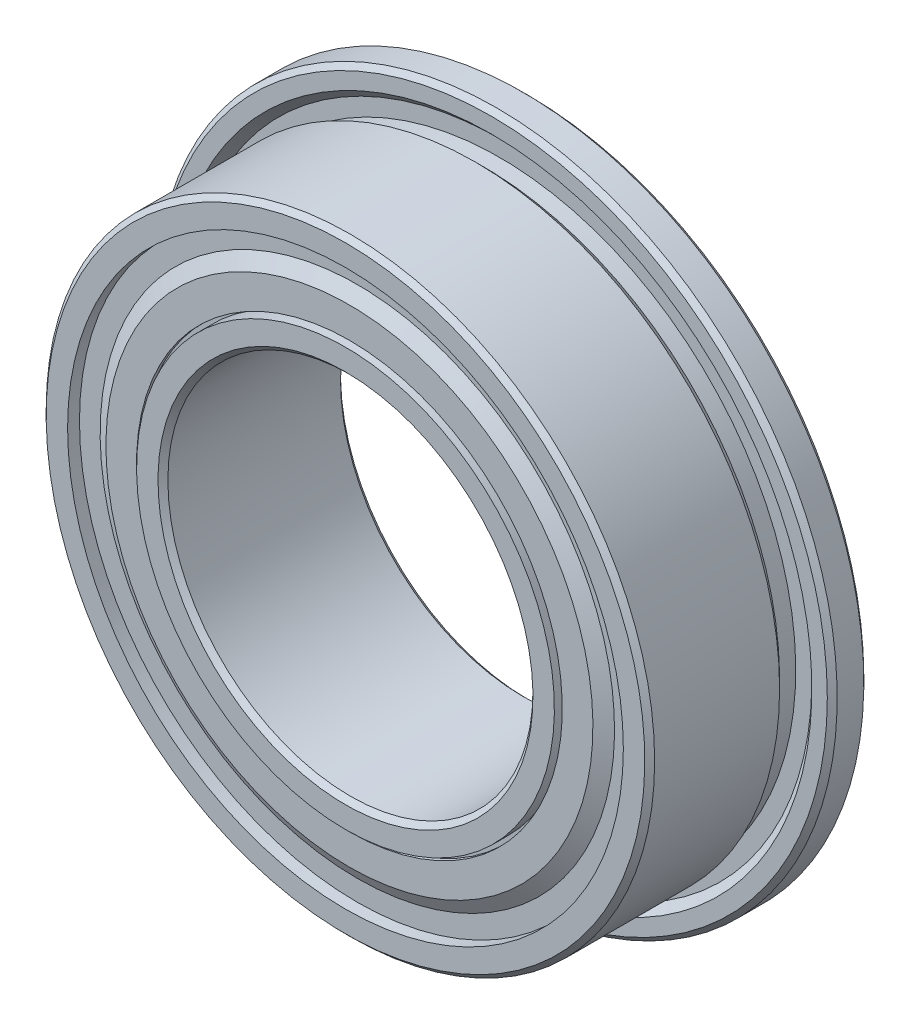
ISO-10303-21;
HEADER;
FILE_DESCRIPTION(('STEP AP214'),'2;1');
FILE_NAME('part.step','',(''),(''),'','','');
FILE_SCHEMA(('AUTOMOTIVE_DESIGN { 1 0 10303 214 1 1 1 1 }'));
ENDSEC;
DATA;
#1=APPLICATION_CONTEXT('core data for automotive mechanical design processes');
#2=APPLICATION_PROTOCOL_DEFINITION('international standard','automotive_design',2000,#1);
#3=PRODUCT_CONTEXT('',#1,'mechanical');
#4=PRODUCT('Part','Part','',(#3));
#5=PRODUCT_RELATED_PRODUCT_CATEGORY('part','',(#4));
#6=PRODUCT_DEFINITION_FORMATION('','',#4);
#7=PRODUCT_DEFINITION_CONTEXT('part definition',#1,'design');
#8=PRODUCT_DEFINITION('design','',#6,#7);
#9=PRODUCT_DEFINITION_SHAPE('','',#8);
#10=(LENGTH_UNIT() NAMED_UNIT(*) SI_UNIT(.MILLI.,.METRE.));
#11=(NAMED_UNIT(*) PLANE_ANGLE_UNIT() SI_UNIT($,.RADIAN.));
#12=(NAMED_UNIT(*) SI_UNIT($,.STERADIAN.) SOLID_ANGLE_UNIT());
#13=UNCERTAINTY_MEASURE_WITH_UNIT(LENGTH_MEASURE(1.E-05),#10,'distance_accuracy_value','');
#14=(GEOMETRIC_REPRESENTATION_CONTEXT(3) GLOBAL_UNCERTAINTY_ASSIGNED_CONTEXT((#13)) GLOBAL_UNIT_ASSIGNED_CONTEXT((#10,
#11,#12)) REPRESENTATION_CONTEXT('',''));
#15=CARTESIAN_POINT('',(0.,0.,0.));
#16=DIRECTION('',(0.,0.,1.));
#17=DIRECTION('',(1.,0.,0.));
#18=AXIS2_PLACEMENT_3D('',#15,#16,#17);
#19=CARTESIAN_POINT('',(0.,0.,0.));
#20=DIRECTION('',(0.,0.,1.));
#21=DIRECTION('',(0.,-1.,0.));
#22=AXIS2_PLACEMENT_3D('',#19,#20,#21);
#23=CYLINDRICAL_SURFACE('',#22,4.56666666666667);
#24=CARTESIAN_POINT('',(0.,0.,-1.24));
#25=DIRECTION('',(0.,0.,1.));
#26=DIRECTION('',(0.,-1.,0.));
#27=AXIS2_PLACEMENT_3D('',#24,#25,#26);
#28=CIRCLE('',#27,4.56666666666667);
#29=CARTESIAN_POINT('',(0.,-4.56666666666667,-1.24));
#30=VERTEX_POINT('',#29);
#31=EDGE_CURVE('E75',#30,#30,#28,.T.);
#32=ORIENTED_EDGE('',*,*,#31,.F.);
#33=EDGE_LOOP('',(#32));
#34=FACE_BOUND('',#33,.T.);
#35=CARTESIAN_POINT('',(0.,0.,-1.305));
#36=DIRECTION('',(0.,0.,1.));
#37=DIRECTION('',(0.,-1.,0.));
#38=AXIS2_PLACEMENT_3D('',#35,#36,#37);
#39=CIRCLE('',#38,4.56666666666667);
#40=CARTESIAN_POINT('',(0.,-4.56666666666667,-1.305));
#41=VERTEX_POINT('',#40);
#42=EDGE_CURVE('E12',#41,#41,#39,.T.);
#43=ORIENTED_EDGE('',*,*,#42,.T.);
#44=EDGE_LOOP('',(#43));
#45=FACE_BOUND('',#44,.T.);
#46=ADVANCED_FACE('F47',(#34,#45),#23,.T.);
#47=CARTESIAN_POINT('',(0.,4.56666666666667,-1.305));
#48=DIRECTION('',(0.,0.,1.));
#49=DIRECTION('',(0.,-1.,0.));
#50=AXIS2_PLACEMENT_3D('',#47,#48,#49);
#51=PLANE('',#50);
#52=ORIENTED_EDGE('',*,*,#42,.F.);
#53=EDGE_LOOP('',(#52));
#54=FACE_BOUND('',#53,.T.);
#55=CARTESIAN_POINT('',(0.,0.,-1.305));
#56=DIRECTION('',(0.,0.,1.));
#57=DIRECTION('',(0.,-1.,0.));
#58=AXIS2_PLACEMENT_3D('',#55,#56,#57);
#59=CIRCLE('',#58,4.22694050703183);
#60=CARTESIAN_POINT('',(0.,-4.22694050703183,-1.305));
#61=VERTEX_POINT('',#60);
#62=EDGE_CURVE('E53',#61,#61,#59,.T.);
#63=ORIENTED_EDGE('',*,*,#62,.T.);
#64=EDGE_LOOP('',(#63));
#65=FACE_BOUND('',#64,.T.);
#66=ADVANCED_FACE('F82',(#54,#65),#51,.F.);
#67=CARTESIAN_POINT('',(0.,0.,-1.435));
#68=DIRECTION('',(0.,0.,1.));
#69=DIRECTION('',(0.,-1.,0.));
#70=AXIS2_PLACEMENT_3D('',#67,#68,#69);
#71=CONICAL_SURFACE('',#70,4.00177390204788,1.0471975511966);
#72=ORIENTED_EDGE('',*,*,#62,.F.);
#73=EDGE_LOOP('',(#72));
#74=FACE_BOUND('',#73,.T.);
#75=CARTESIAN_POINT('',(0.,0.,-1.435));
#76=DIRECTION('',(0.,0.,1.));
#77=DIRECTION('',(0.,-1.,0.));
#78=AXIS2_PLACEMENT_3D('',#75,#76,#77);
#79=CIRCLE('',#78,4.00177390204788);
#80=CARTESIAN_POINT('',(0.,-4.00177390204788,-1.435));
#81=VERTEX_POINT('',#80);
#82=EDGE_CURVE('E57',#81,#81,#79,.T.);
#83=ORIENTED_EDGE('',*,*,#82,.T.);
#84=EDGE_LOOP('',(#83));
#85=FACE_BOUND('',#84,.T.);
#86=ADVANCED_FACE('F86',(#74,#85),#71,.T.);
#87=CARTESIAN_POINT('',(0.,4.00177390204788,-1.435));
#88=DIRECTION('',(0.,0.,1.));
#89=DIRECTION('',(0.,-1.,0.));
#90=AXIS2_PLACEMENT_3D('',#87,#88,#89);
#91=PLANE('',#90);
#92=ORIENTED_EDGE('',*,*,#82,.F.);
#93=EDGE_LOOP('',(#92));
#94=FACE_BOUND('',#93,.T.);
#95=CARTESIAN_POINT('',(0.,0.,-1.435));
#96=DIRECTION('',(0.,0.,1.));
#97=DIRECTION('',(0.,-1.,0.));
#98=AXIS2_PLACEMENT_3D('',#95,#96,#97);
#99=CIRCLE('',#98,3.49833333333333);
#100=CARTESIAN_POINT('',(0.,-3.49833333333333,-1.435));
#101=VERTEX_POINT('',#100);
#102=EDGE_CURVE('E61',#101,#101,#99,.T.);
#103=ORIENTED_EDGE('',*,*,#102,.T.);
#104=EDGE_LOOP('',(#103));
#105=FACE_BOUND('',#104,.T.);
#106=ADVANCED_FACE('F91',(#94,#105),#91,.F.);
#107=CARTESIAN_POINT('',(0.,0.,0.));
#108=DIRECTION('',(0.,0.,1.));
#109=DIRECTION('',(0.,-1.,0.));
#110=AXIS2_PLACEMENT_3D('',#107,#108,#109);
#111=CYLINDRICAL_SURFACE('',#110,3.49833333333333);
#112=ORIENTED_EDGE('',*,*,#102,.F.);
#113=EDGE_LOOP('',(#112));
#114=FACE_BOUND('',#113,.T.);
#115=CARTESIAN_POINT('',(0.,0.,-1.37));
#116=DIRECTION('',(0.,0.,1.));
#117=DIRECTION('',(0.,-1.,0.));
#118=AXIS2_PLACEMENT_3D('',#115,#116,#117);
#119=CIRCLE('',#118,3.49833333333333);
#120=CARTESIAN_POINT('',(0.,-3.49833333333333,-1.37));
#121=VERTEX_POINT('',#120);
#122=EDGE_CURVE('E66',#121,#121,#119,.T.);
#123=ORIENTED_EDGE('',*,*,#122,.T.);
#124=EDGE_LOOP('',(#123));
#125=FACE_BOUND('',#124,.T.);
#126=ADVANCED_FACE('F97',(#114,#125),#111,.F.);
#127=CARTESIAN_POINT('',(0.,3.98435720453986,-1.37));
#128=DIRECTION('',(0.,0.,-1.));
#129=DIRECTION('',(0.,1.,0.));
#130=AXIS2_PLACEMENT_3D('',#127,#128,#129);
#131=PLANE('',#130);
#132=ORIENTED_EDGE('',*,*,#122,.F.);
#133=EDGE_LOOP('',(#132));
#134=FACE_BOUND('',#133,.T.);
#135=CARTESIAN_POINT('',(0.,0.,-1.37));
#136=DIRECTION('',(0.,0.,1.));
#137=DIRECTION('',(0.,-1.,0.));
#138=AXIS2_PLACEMENT_3D('',#135,#136,#137);
#139=CIRCLE('',#138,3.98435720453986);
#140=CARTESIAN_POINT('',(0.,-3.98435720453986,-1.37));
#141=VERTEX_POINT('',#140);
#142=EDGE_CURVE('E69',#141,#141,#139,.T.);
#143=ORIENTED_EDGE('',*,*,#142,.T.);
#144=EDGE_LOOP('',(#143));
#145=FACE_BOUND('',#144,.T.);
#146=ADVANCED_FACE('F101',(#134,#145),#131,.F.);
#147=CARTESIAN_POINT('',(0.,0.,-1.24));
#148=DIRECTION('',(0.,0.,1.));
#149=DIRECTION('',(0.,-1.,0.));
#150=AXIS2_PLACEMENT_3D('',#147,#148,#149);
#151=CONICAL_SURFACE('',#150,4.20952380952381,1.04719755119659);
#152=ORIENTED_EDGE('',*,*,#142,.F.);
#153=EDGE_LOOP('',(#152));
#154=FACE_BOUND('',#153,.T.);
#155=CARTESIAN_POINT('',(0.,0.,-1.24));
#156=DIRECTION('',(0.,0.,1.));
#157=DIRECTION('',(0.,-1.,0.));
#158=AXIS2_PLACEMENT_3D('',#155,#156,#157);
#159=CIRCLE('',#158,4.20952380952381);
#160=CARTESIAN_POINT('',(0.,-4.20952380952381,-1.24));
#161=VERTEX_POINT('',#160);
#162=EDGE_CURVE('E72',#161,#161,#159,.T.);
#163=ORIENTED_EDGE('',*,*,#162,.T.);
#164=EDGE_LOOP('',(#163));
#165=FACE_BOUND('',#164,.T.);
#166=ADVANCED_FACE('F105',(#154,#165),#151,.F.);
#167=CARTESIAN_POINT('',(0.,4.56666666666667,-1.24));
#168=DIRECTION('',(0.,0.,-1.));
#169=DIRECTION('',(0.,1.,0.));
#170=AXIS2_PLACEMENT_3D('',#167,#168,#169);
#171=PLANE('',#170);
#172=ORIENTED_EDGE('',*,*,#162,.F.);
#173=EDGE_LOOP('',(#172));
#174=FACE_BOUND('',#173,.T.);
#175=ORIENTED_EDGE('',*,*,#31,.T.);
#176=EDGE_LOOP('',(#175));
#177=FACE_BOUND('',#176,.T.);
#178=ADVANCED_FACE('F79',(#174,#177),#171,.F.);
#179=CLOSED_SHELL('',(#46,#66,#86,#106,#126,#146,#166,#178));
#180=MANIFOLD_SOLID_BREP('B2',#179);
#181=CARTESIAN_POINT('',(0.,0.,0.));
#182=DIRECTION('',(0.,0.,1.));
#183=DIRECTION('',(0.,-1.,0.));
#184=AXIS2_PLACEMENT_3D('',#181,#182,#183);
#185=CYLINDRICAL_SURFACE('',#184,4.56666666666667);
#186=CARTESIAN_POINT('',(0.,0.,1.305));
#187=DIRECTION('',(0.,0.,1.));
#188=DIRECTION('',(0.,-1.,0.));
#189=AXIS2_PLACEMENT_3D('',#186,#187,#188);
#190=CIRCLE('',#189,4.56666666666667);
#191=CARTESIAN_POINT('',(0.,-4.56666666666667,1.305));
#192=VERTEX_POINT('',#191);
#193=EDGE_CURVE('E46',#192,#192,#190,.T.);
#194=ORIENTED_EDGE('',*,*,#193,.F.);
#195=EDGE_LOOP('',(#194));
#196=FACE_BOUND('',#195,.T.);
#197=CARTESIAN_POINT('',(0.,0.,1.24));
#198=DIRECTION('',(0.,0.,1.));
#199=DIRECTION('',(0.,-1.,0.));
#200=AXIS2_PLACEMENT_3D('',#197,#198,#199);
#201=CIRCLE('',#200,4.56666666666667);
#202=CARTESIAN_POINT('',(0.,-4.56666666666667,1.24));
#203=VERTEX_POINT('',#202);
#204=EDGE_CURVE('E202',#203,#203,#201,.T.);
#205=ORIENTED_EDGE('',*,*,#204,.T.);
#206=EDGE_LOOP('',(#205));
#207=FACE_BOUND('',#206,.T.);
#208=ADVANCED_FACE('F174',(#196,#207),#185,.T.);
#209=CARTESIAN_POINT('',(0.,4.56666666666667,1.305));
#210=DIRECTION('',(0.,0.,-1.));
#211=DIRECTION('',(0.,1.,0.));
#212=AXIS2_PLACEMENT_3D('',#209,#210,#211);
#213=PLANE('',#212);
#214=CARTESIAN_POINT('',(0.,0.,1.305));
#215=DIRECTION('',(0.,0.,1.));
#216=DIRECTION('',(0.,-1.,0.));
#217=AXIS2_PLACEMENT_3D('',#214,#215,#216);
#218=CIRCLE('',#217,4.22694050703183);
#219=CARTESIAN_POINT('',(0.,-4.22694050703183,1.305));
#220=VERTEX_POINT('',#219);
#221=EDGE_CURVE('E180',#220,#220,#218,.T.);
#222=ORIENTED_EDGE('',*,*,#221,.F.);
#223=EDGE_LOOP('',(#222));
#224=FACE_BOUND('',#223,.T.);
#225=ORIENTED_EDGE('',*,*,#193,.T.);
#226=EDGE_LOOP('',(#225));
#227=FACE_BOUND('',#226,.T.);
#228=ADVANCED_FACE('F239',(#224,#227),#213,.F.);
#229=CARTESIAN_POINT('',(0.,0.,1.305));
#230=DIRECTION('',(0.,0.,-1.));
#231=DIRECTION('',(0.,1.,0.));
#232=AXIS2_PLACEMENT_3D('',#229,#230,#231);
#233=CONICAL_SURFACE('',#232,4.22694050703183,1.0471975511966);
#234=CARTESIAN_POINT('',(0.,0.,1.435));
#235=DIRECTION('',(0.,0.,1.));
#236=DIRECTION('',(0.,-1.,0.));
#237=AXIS2_PLACEMENT_3D('',#234,#235,#236);
#238=CIRCLE('',#237,4.00177390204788);
#239=CARTESIAN_POINT('',(0.,-4.00177390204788,1.435));
#240=VERTEX_POINT('',#239);
#241=EDGE_CURVE('E184',#240,#240,#238,.T.);
#242=ORIENTED_EDGE('',*,*,#241,.F.);
#243=EDGE_LOOP('',(#242));
#244=FACE_BOUND('',#243,.T.);
#245=ORIENTED_EDGE('',*,*,#221,.T.);
#246=EDGE_LOOP('',(#245));
#247=FACE_BOUND('',#246,.T.);
#248=ADVANCED_FACE('F234',(#244,#247),#233,.T.);
#249=CARTESIAN_POINT('',(0.,4.00177390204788,1.435));
#250=DIRECTION('',(0.,0.,-1.));
#251=DIRECTION('',(0.,1.,0.));
#252=AXIS2_PLACEMENT_3D('',#249,#250,#251);
#253=PLANE('',#252);
#254=CARTESIAN_POINT('',(0.,0.,1.435));
#255=DIRECTION('',(0.,0.,1.));
#256=DIRECTION('',(0.,-1.,0.));
#257=AXIS2_PLACEMENT_3D('',#254,#255,#256);
#258=CIRCLE('',#257,3.49833333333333);
#259=CARTESIAN_POINT('',(0.,-3.49833333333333,1.435));
#260=VERTEX_POINT('',#259);
#261=EDGE_CURVE('E188',#260,#260,#258,.T.);
#262=ORIENTED_EDGE('',*,*,#261,.F.);
#263=EDGE_LOOP('',(#262));
#264=FACE_BOUND('',#263,.T.);
#265=ORIENTED_EDGE('',*,*,#241,.T.);
#266=EDGE_LOOP('',(#265));
#267=FACE_BOUND('',#266,.T.);
#268=ADVANCED_FACE('F228',(#264,#267),#253,.F.);
#269=CARTESIAN_POINT('',(0.,0.,0.));
#270=DIRECTION('',(0.,0.,1.));
#271=DIRECTION('',(0.,-1.,0.));
#272=AXIS2_PLACEMENT_3D('',#269,#270,#271);
#273=CYLINDRICAL_SURFACE('',#272,3.49833333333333);
#274=CARTESIAN_POINT('',(0.,0.,1.37));
#275=DIRECTION('',(0.,0.,1.));
#276=DIRECTION('',(0.,-1.,0.));
#277=AXIS2_PLACEMENT_3D('',#274,#275,#276);
#278=CIRCLE('',#277,3.49833333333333);
#279=CARTESIAN_POINT('',(0.,-3.49833333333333,1.37));
#280=VERTEX_POINT('',#279);
#281=EDGE_CURVE('E193',#280,#280,#278,.T.);
#282=ORIENTED_EDGE('',*,*,#281,.F.);
#283=EDGE_LOOP('',(#282));
#284=FACE_BOUND('',#283,.T.);
#285=ORIENTED_EDGE('',*,*,#261,.T.);
#286=EDGE_LOOP('',(#285));
#287=FACE_BOUND('',#286,.T.);
#288=ADVANCED_FACE('F222',(#284,#287),#273,.F.);
#289=CARTESIAN_POINT('',(0.,3.98435720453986,1.37));
#290=DIRECTION('',(0.,0.,1.));
#291=DIRECTION('',(0.,-1.,0.));
#292=AXIS2_PLACEMENT_3D('',#289,#290,#291);
#293=PLANE('',#292);
#294=CARTESIAN_POINT('',(0.,0.,1.37));
#295=DIRECTION('',(0.,0.,1.));
#296=DIRECTION('',(0.,-1.,0.));
#297=AXIS2_PLACEMENT_3D('',#294,#295,#296);
#298=CIRCLE('',#297,3.98435720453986);
#299=CARTESIAN_POINT('',(0.,-3.98435720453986,1.37));
#300=VERTEX_POINT('',#299);
#301=EDGE_CURVE('E196',#300,#300,#298,.T.);
#302=ORIENTED_EDGE('',*,*,#301,.F.);
#303=EDGE_LOOP('',(#302));
#304=FACE_BOUND('',#303,.T.);
#305=ORIENTED_EDGE('',*,*,#281,.T.);
#306=EDGE_LOOP('',(#305));
#307=FACE_BOUND('',#306,.T.);
#308=ADVANCED_FACE('F216',(#304,#307),#293,.F.);
#309=CARTESIAN_POINT('',(0.,0.,1.37));
#310=DIRECTION('',(0.,0.,-1.));
#311=DIRECTION('',(0.,1.,0.));
#312=AXIS2_PLACEMENT_3D('',#309,#310,#311);
#313=CONICAL_SURFACE('',#312,3.98435720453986,1.0471975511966);
#314=CARTESIAN_POINT('',(0.,0.,1.24));
#315=DIRECTION('',(0.,0.,1.));
#316=DIRECTION('',(0.,-1.,0.));
#317=AXIS2_PLACEMENT_3D('',#314,#315,#316);
#318=CIRCLE('',#317,4.20952380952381);
#319=CARTESIAN_POINT('',(0.,-4.20952380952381,1.24));
#320=VERTEX_POINT('',#319);
#321=EDGE_CURVE('E199',#320,#320,#318,.T.);
#322=ORIENTED_EDGE('',*,*,#321,.F.);
#323=EDGE_LOOP('',(#322));
#324=FACE_BOUND('',#323,.T.);
#325=ORIENTED_EDGE('',*,*,#301,.T.);
#326=EDGE_LOOP('',(#325));
#327=FACE_BOUND('',#326,.T.);
#328=ADVANCED_FACE('F210',(#324,#327),#313,.F.);
#329=CARTESIAN_POINT('',(0.,4.56666666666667,1.24));
#330=DIRECTION('',(0.,0.,1.));
#331=DIRECTION('',(0.,-1.,0.));
#332=AXIS2_PLACEMENT_3D('',#329,#330,#331);
#333=PLANE('',#332);
#334=ORIENTED_EDGE('',*,*,#204,.F.);
#335=EDGE_LOOP('',(#334));
#336=FACE_BOUND('',#335,.T.);
#337=ORIENTED_EDGE('',*,*,#321,.T.);
#338=EDGE_LOOP('',(#337));
#339=FACE_BOUND('',#338,.T.);
#340=ADVANCED_FACE('F207',(#336,#339),#333,.F.);
#341=CLOSED_SHELL('',(#208,#228,#248,#268,#288,#308,#328,#340));
#342=MANIFOLD_SOLID_BREP('B7',#341);
#343=CARTESIAN_POINT('',(-1.44496666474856,3.72988891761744,0.));
#344=DIRECTION('',(-0.361241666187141,0.932472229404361,0.));
#345=DIRECTION('',(0.932472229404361,0.361241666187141,0.));
#346=AXIS2_PLACEMENT_3D('',#343,#344,#345);
#347=SPHERICAL_SURFACE('',#346,0.6);
#348=CARTESIAN_POINT('',(-1.66171166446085,4.28937225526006,0.));
#349=VERTEX_POINT('',#348);
#350=VERTEX_LOOP('',#349);
#351=FACE_BOUND('',#350,.T.);
#352=ADVANCED_FACE('F301',(#351),#347,.T.);
#353=CLOSED_SHELL('',(#352));
#354=MANIFOLD_SOLID_BREP('B41',#353);
#355=CARTESIAN_POINT('',(-2.69478257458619,2.95603566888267,0.));
#356=DIRECTION('',(-0.673695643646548,0.739008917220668,0.));
#357=DIRECTION('',(0.739008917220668,0.673695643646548,0.));
#358=AXIS2_PLACEMENT_3D('',#355,#356,#357);
#359=SPHERICAL_SURFACE('',#358,0.6);
#360=CARTESIAN_POINT('',(-3.09899996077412,3.39944101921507,0.));
#361=VERTEX_POINT('',#360);
#362=VERTEX_LOOP('',#361);
#363=FACE_BOUND('',#362,.T.);
#364=ADVANCED_FACE('F319',(#363),#359,.T.);
#365=CLOSED_SHELL('',(#364));
#366=MANIFOLD_SOLID_BREP('B170',#365);
#367=CARTESIAN_POINT('',(-3.58065316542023,1.7829534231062,0.));
#368=DIRECTION('',(-0.895163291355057,0.445738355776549,0.));
#369=DIRECTION('',(0.445738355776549,0.895163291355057,0.));
#370=AXIS2_PLACEMENT_3D('',#367,#368,#369);
#371=SPHERICAL_SURFACE('',#370,0.6);
#372=CARTESIAN_POINT('',(-4.11775114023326,2.05039643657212,0.));
#373=VERTEX_POINT('',#372);
#374=VERTEX_LOOP('',#373);
#375=FACE_BOUND('',#374,.T.);
#376=ADVANCED_FACE('F337',(#375),#371,.T.);
#377=CLOSED_SHELL('',(#376));
#378=MANIFOLD_SOLID_BREP('B297',#377);
#379=CARTESIAN_POINT('',(-3.98293670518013,0.369073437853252,0.));
#380=DIRECTION('',(-0.995734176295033,0.092268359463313,0.));
#381=DIRECTION('',(0.092268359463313,0.995734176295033,0.));
#382=AXIS2_PLACEMENT_3D('',#379,#380,#381);
#383=SPHERICAL_SURFACE('',#382,0.6);
#384=CARTESIAN_POINT('',(-4.58037721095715,0.42443445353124,0.));
#385=VERTEX_POINT('',#384);
#386=VERTEX_LOOP('',#385);
#387=FACE_BOUND('',#386,.T.);
#388=ADVANCED_FACE('F355',(#387),#383,.T.);
#389=CLOSED_SHELL('',(#388));
#390=MANIFOLD_SOLID_BREP('B315',#389);
#391=CARTESIAN_POINT('',(-3.84730257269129,-1.09465196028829,0.));
#392=DIRECTION('',(-0.961825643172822,-0.273662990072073,0.));
#393=DIRECTION('',(-0.273662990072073,0.961825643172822,0.));
#394=AXIS2_PLACEMENT_3D('',#391,#392,#393);
#395=SPHERICAL_SURFACE('',#394,0.6);
#396=CARTESIAN_POINT('',(-4.42439795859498,-1.25884975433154,0.));
#397=VERTEX_POINT('',#396);
#398=VERTEX_LOOP('',#397);
#399=FACE_BOUND('',#398,.T.);
#400=ADVANCED_FACE('F373',(#399),#395,.T.);
#401=CLOSED_SHELL('',(#400));
#402=MANIFOLD_SOLID_BREP('B333',#401);
#403=CARTESIAN_POINT('',(-3.19206890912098,-2.410538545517,0.));
#404=DIRECTION('',(-0.798017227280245,-0.602634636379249,0.));
#405=DIRECTION('',(-0.602634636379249,0.798017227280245,0.));
#406=AXIS2_PLACEMENT_3D('',#403,#404,#405);
#407=SPHERICAL_SURFACE('',#406,0.6);
#408=CARTESIAN_POINT('',(-3.67087924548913,-2.77211932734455,0.));
#409=VERTEX_POINT('',#408);
#410=VERTEX_LOOP('',#409);
#411=FACE_BOUND('',#410,.T.);
#412=ADVANCED_FACE('F391',(#411),#407,.T.);
#413=CLOSED_SHELL('',(#412));
#414=MANIFOLD_SOLID_BREP('B351',#413);
#415=CARTESIAN_POINT('',(-2.10572865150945,-3.40086854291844,0.));
#416=DIRECTION('',(-0.526432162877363,-0.85021713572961,0.));
#417=DIRECTION('',(-0.85021713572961,0.526432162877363,0.));
#418=AXIS2_PLACEMENT_3D('',#415,#416,#417);
#419=SPHERICAL_SURFACE('',#418,0.6);
#420=CARTESIAN_POINT('',(-2.42158794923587,-3.91099882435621,0.));
#421=VERTEX_POINT('',#420);
#422=VERTEX_LOOP('',#421);
#423=FACE_BOUND('',#422,.T.);
#424=ADVANCED_FACE('F409',(#423),#419,.T.);
#425=CLOSED_SHELL('',(#424));
#426=MANIFOLD_SOLID_BREP('B369',#425);
#427=CARTESIAN_POINT('',(-0.73499807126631,-3.9318923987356,0.));
#428=DIRECTION('',(-0.183749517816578,-0.9829730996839,0.));
#429=DIRECTION('',(-0.9829730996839,0.183749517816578,0.));
#430=AXIS2_PLACEMENT_3D('',#427,#428,#429);
#431=SPHERICAL_SURFACE('',#430,0.6);
#432=CARTESIAN_POINT('',(-0.845247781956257,-4.52167625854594,0.));
#433=VERTEX_POINT('',#432);
#434=VERTEX_LOOP('',#433);
#435=FACE_BOUND('',#434,.T.);
#436=ADVANCED_FACE('F427',(#435),#431,.T.);
#437=CLOSED_SHELL('',(#436));
#438=MANIFOLD_SOLID_BREP('B387',#437);
#439=CARTESIAN_POINT('',(0.734998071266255,-3.93189239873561,0.));
#440=DIRECTION('',(0.183749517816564,-0.982973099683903,0.));
#441=DIRECTION('',(-0.982973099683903,-0.183749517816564,0.));
#442=AXIS2_PLACEMENT_3D('',#439,#440,#441);
#443=SPHERICAL_SURFACE('',#442,0.6);
#444=CARTESIAN_POINT('',(0.845247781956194,-4.52167625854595,0.));
#445=VERTEX_POINT('',#444);
#446=VERTEX_LOOP('',#445);
#447=FACE_BOUND('',#446,.T.);
#448=ADVANCED_FACE('F445',(#447),#443,.T.);
#449=CLOSED_SHELL('',(#448));
#450=MANIFOLD_SOLID_BREP('B405',#449);
#451=CARTESIAN_POINT('',(2.1057286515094,-3.40086854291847,0.));
#452=DIRECTION('',(0.526432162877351,-0.850217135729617,0.));
#453=DIRECTION('',(-0.850217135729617,-0.526432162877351,0.));
#454=AXIS2_PLACEMENT_3D('',#451,#452,#453);
#455=SPHERICAL_SURFACE('',#454,0.6);
#456=CARTESIAN_POINT('',(2.42158794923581,-3.91099882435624,0.));
#457=VERTEX_POINT('',#456);
#458=VERTEX_LOOP('',#457);
#459=FACE_BOUND('',#458,.T.);
#460=ADVANCED_FACE('F463',(#459),#455,.T.);
#461=CLOSED_SHELL('',(#460));
#462=MANIFOLD_SOLID_BREP('B423',#461);
#463=CARTESIAN_POINT('',(3.19206890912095,-2.41053854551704,0.));
#464=DIRECTION('',(0.798017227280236,-0.602634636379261,0.));
#465=DIRECTION('',(-0.602634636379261,-0.798017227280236,0.));
#466=AXIS2_PLACEMENT_3D('',#463,#464,#465);
#467=SPHERICAL_SURFACE('',#466,0.6);
#468=CARTESIAN_POINT('',(3.67087924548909,-2.7721193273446,0.));
#469=VERTEX_POINT('',#468);
#470=VERTEX_LOOP('',#469);
#471=FACE_BOUND('',#470,.T.);
#472=ADVANCED_FACE('F481',(#471),#467,.T.);
#473=CLOSED_SHELL('',(#472));
#474=MANIFOLD_SOLID_BREP('B441',#473);
#475=CARTESIAN_POINT('',(3.84730257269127,-1.09465196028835,0.));
#476=DIRECTION('',(0.961825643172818,-0.273662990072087,0.));
#477=DIRECTION('',(-0.273662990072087,-0.961825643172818,0.));
#478=AXIS2_PLACEMENT_3D('',#475,#476,#477);
#479=SPHERICAL_SURFACE('',#478,0.6);
#480=CARTESIAN_POINT('',(4.42439795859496,-1.2588497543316,0.));
#481=VERTEX_POINT('',#480);
#482=VERTEX_LOOP('',#481);
#483=FACE_BOUND('',#482,.T.);
#484=ADVANCED_FACE('F499',(#483),#479,.T.);
#485=CLOSED_SHELL('',(#484));
#486=MANIFOLD_SOLID_BREP('B459',#485);
#487=CARTESIAN_POINT('',(3.98293670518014,0.369073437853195,0.));
#488=DIRECTION('',(0.995734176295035,0.0922683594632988,0.));
#489=DIRECTION('',(0.0922683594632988,-0.995734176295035,0.));
#490=AXIS2_PLACEMENT_3D('',#487,#488,#489);
#491=SPHERICAL_SURFACE('',#490,0.6);
#492=CARTESIAN_POINT('',(4.58037721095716,0.424434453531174,0.));
#493=VERTEX_POINT('',#492);
#494=VERTEX_LOOP('',#493);
#495=FACE_BOUND('',#494,.T.);
#496=ADVANCED_FACE('F517',(#495),#491,.T.);
#497=CLOSED_SHELL('',(#496));
#498=MANIFOLD_SOLID_BREP('B477',#497);
#499=CARTESIAN_POINT('',(3.58065316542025,1.78295342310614,0.));
#500=DIRECTION('',(0.895163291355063,0.445738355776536,0.));
#501=DIRECTION('',(0.445738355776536,-0.895163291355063,0.));
#502=AXIS2_PLACEMENT_3D('',#499,#500,#501);
#503=SPHERICAL_SURFACE('',#502,0.6);
#504=CARTESIAN_POINT('',(4.11775114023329,2.05039643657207,0.));
#505=VERTEX_POINT('',#504);
#506=VERTEX_LOOP('',#505);
#507=FACE_BOUND('',#506,.T.);
#508=ADVANCED_FACE('F535',(#507),#503,.T.);
#509=CLOSED_SHELL('',(#508));
#510=MANIFOLD_SOLID_BREP('B495',#509);
#511=CARTESIAN_POINT('',(2.69478257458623,2.95603566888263,0.));
#512=DIRECTION('',(0.673695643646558,0.739008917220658,0.));
#513=DIRECTION('',(0.739008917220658,-0.673695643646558,0.));
#514=AXIS2_PLACEMENT_3D('',#511,#512,#513);
#515=SPHERICAL_SURFACE('',#514,0.6);
#516=CARTESIAN_POINT('',(3.09899996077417,3.39944101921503,0.));
#517=VERTEX_POINT('',#516);
#518=VERTEX_LOOP('',#517);
#519=FACE_BOUND('',#518,.T.);
#520=ADVANCED_FACE('F553',(#519),#515,.T.);
#521=CLOSED_SHELL('',(#520));
#522=MANIFOLD_SOLID_BREP('B513',#521);
#523=CARTESIAN_POINT('',(1.44496666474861,3.72988891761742,0.));
#524=DIRECTION('',(0.361241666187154,0.932472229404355,0.));
#525=DIRECTION('',(0.932472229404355,-0.361241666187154,0.));
#526=AXIS2_PLACEMENT_3D('',#523,#524,#525);
#527=SPHERICAL_SURFACE('',#526,0.6);
#528=CARTESIAN_POINT('',(1.66171166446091,4.28937225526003,0.));
#529=VERTEX_POINT('',#528);
#530=VERTEX_LOOP('',#529);
#531=FACE_BOUND('',#530,.T.);
#532=ADVANCED_FACE('F571',(#531),#527,.T.);
#533=CLOSED_SHELL('',(#532));
#534=MANIFOLD_SOLID_BREP('B531',#533);
#535=CARTESIAN_POINT('',(0.,4.,0.));
#536=DIRECTION('',(0.,1.,0.));
#537=DIRECTION('',(1.,0.,0.));
#538=AXIS2_PLACEMENT_3D('',#535,#536,#537);
#539=SPHERICAL_SURFACE('',#538,0.6);
#540=CARTESIAN_POINT('',(0.,4.6,0.));
#541=VERTEX_POINT('',#540);
#542=VERTEX_LOOP('',#541);
#543=FACE_BOUND('',#542,.T.);
#544=ADVANCED_FACE('F592',(#543),#539,.T.);
#545=CLOSED_SHELL('',(#544));
#546=MANIFOLD_SOLID_BREP('B549',#545);
#547=CARTESIAN_POINT('',(0.,0.,0.));
#548=DIRECTION('',(0.,0.,1.));
#549=DIRECTION('',(0.,-1.,0.));
#550=AXIS2_PLACEMENT_3D('',#547,#548,#549);
#551=CYLINDRICAL_SURFACE('',#550,3.65);
#552=CARTESIAN_POINT('',(0.,0.,0.487339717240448));
#553=DIRECTION('',(0.,0.,1.));
#554=DIRECTION('',(0.,-1.,0.));
#555=AXIS2_PLACEMENT_3D('',#552,#553,#554);
#556=CIRCLE('',#555,3.65);
#557=CARTESIAN_POINT('',(0.,-3.65,0.487339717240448));
#558=VERTEX_POINT('',#557);
#559=EDGE_CURVE('E636',#558,#558,#556,.T.);
#560=ORIENTED_EDGE('',*,*,#559,.T.);
#561=EDGE_LOOP('',(#560));
#562=FACE_BOUND('',#561,.T.);
#563=CARTESIAN_POINT('',(0.,0.,1.24));
#564=DIRECTION('',(0.,0.,1.));
#565=DIRECTION('',(0.,-1.,0.));
#566=AXIS2_PLACEMENT_3D('',#563,#564,#565);
#567=CIRCLE('',#566,3.65);
#568=CARTESIAN_POINT('',(0.,-3.65,1.24));
#569=VERTEX_POINT('',#568);
#570=EDGE_CURVE('E654',#569,#569,#567,.T.);
#571=ORIENTED_EDGE('',*,*,#570,.F.);
#572=EDGE_LOOP('',(#571));
#573=FACE_BOUND('',#572,.T.);
#574=ADVANCED_FACE('F613',(#562,#573),#551,.T.);
#575=CARTESIAN_POINT('',(0.,3.,1.5));
#576=DIRECTION('',(0.,0.,-1.));
#577=DIRECTION('',(0.,1.,0.));
#578=AXIS2_PLACEMENT_3D('',#575,#576,#577);
#579=PLANE('',#578);
#580=CARTESIAN_POINT('',(0.,0.,1.5));
#581=DIRECTION('',(0.,0.,-1.));
#582=DIRECTION('',(0.,1.,0.));
#583=AXIS2_PLACEMENT_3D('',#580,#581,#582);
#584=CIRCLE('',#583,3.08125);
#585=CARTESIAN_POINT('',(0.,3.08125,1.5));
#586=VERTEX_POINT('',#585);
#587=EDGE_CURVE('E591',#586,#586,#584,.T.);
#588=ORIENTED_EDGE('',*,*,#587,.T.);
#589=EDGE_LOOP('',(#588));
#590=FACE_BOUND('',#589,.T.);
#591=CARTESIAN_POINT('',(0.,0.,1.5));
#592=DIRECTION('',(0.,0.,1.));
#593=DIRECTION('',(0.,-1.,0.));
#594=AXIS2_PLACEMENT_3D('',#591,#592,#593);
#595=CIRCLE('',#594,3.43333333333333);
#596=CARTESIAN_POINT('',(0.,-3.43333333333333,1.5));
#597=VERTEX_POINT('',#596);
#598=EDGE_CURVE('E648',#597,#597,#595,.T.);
#599=ORIENTED_EDGE('',*,*,#598,.T.);
#600=EDGE_LOOP('',(#599));
#601=FACE_BOUND('',#600,.T.);
#602=ADVANCED_FACE('F662',(#590,#601),#579,.F.);
#603=CARTESIAN_POINT('',(0.,0.,0.));
#604=DIRECTION('',(0.,0.,1.));
#605=DIRECTION('',(0.,-1.,0.));
#606=AXIS2_PLACEMENT_3D('',#603,#604,#605);
#607=CYLINDRICAL_SURFACE('',#606,3.65);
#608=CARTESIAN_POINT('',(0.,0.,-0.487339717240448));
#609=DIRECTION('',(0.,0.,1.));
#610=DIRECTION('',(0.,-1.,0.));
#611=AXIS2_PLACEMENT_3D('',#608,#609,#610);
#612=CIRCLE('',#611,3.65);
#613=CARTESIAN_POINT('',(0.,-3.65,-0.487339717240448));
#614=VERTEX_POINT('',#613);
#615=EDGE_CURVE('E633',#614,#614,#612,.T.);
#616=ORIENTED_EDGE('',*,*,#615,.F.);
#617=EDGE_LOOP('',(#616));
#618=FACE_BOUND('',#617,.T.);
#619=CARTESIAN_POINT('',(0.,0.,-1.24));
#620=DIRECTION('',(0.,0.,1.));
#621=DIRECTION('',(0.,-1.,0.));
#622=AXIS2_PLACEMENT_3D('',#619,#620,#621);
#623=CIRCLE('',#622,3.65);
#624=CARTESIAN_POINT('',(0.,-3.65,-1.24));
#625=VERTEX_POINT('',#624);
#626=EDGE_CURVE('E645',#625,#625,#623,.T.);
#627=ORIENTED_EDGE('',*,*,#626,.T.);
#628=EDGE_LOOP('',(#627));
#629=FACE_BOUND('',#628,.T.);
#630=ADVANCED_FACE('F668',(#618,#629),#607,.T.);
#631=CARTESIAN_POINT('',(0.,3.65,-1.5));
#632=DIRECTION('',(0.,0.,1.));
#633=DIRECTION('',(0.,-1.,0.));
#634=AXIS2_PLACEMENT_3D('',#631,#632,#633);
#635=PLANE('',#634);
#636=CARTESIAN_POINT('',(0.,0.,-1.5));
#637=DIRECTION('',(0.,0.,1.));
#638=DIRECTION('',(0.,-1.,0.));
#639=AXIS2_PLACEMENT_3D('',#636,#637,#638);
#640=CIRCLE('',#639,3.08125);
#641=CARTESIAN_POINT('',(0.,-3.08125,-1.5));
#642=VERTEX_POINT('',#641);
#643=EDGE_CURVE('E628',#642,#642,#640,.T.);
#644=ORIENTED_EDGE('',*,*,#643,.T.);
#645=EDGE_LOOP('',(#644));
#646=FACE_BOUND('',#645,.T.);
#647=CARTESIAN_POINT('',(0.,0.,-1.5));
#648=DIRECTION('',(0.,0.,1.));
#649=DIRECTION('',(0.,-1.,0.));
#650=AXIS2_PLACEMENT_3D('',#647,#648,#649);
#651=CIRCLE('',#650,3.43333333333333);
#652=CARTESIAN_POINT('',(0.,-3.43333333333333,-1.5));
#653=VERTEX_POINT('',#652);
#654=EDGE_CURVE('E639',#653,#653,#651,.T.);
#655=ORIENTED_EDGE('',*,*,#654,.F.);
#656=EDGE_LOOP('',(#655));
#657=FACE_BOUND('',#656,.T.);
#658=ADVANCED_FACE('F676',(#646,#657),#635,.F.);
#659=CARTESIAN_POINT('',(0.,0.,0.));
#660=DIRECTION('',(0.,0.,1.));
#661=DIRECTION('',(0.,-1.,0.));
#662=AXIS2_PLACEMENT_3D('',#659,#660,#661);
#663=TOROIDAL_SURFACE('',#662,4.,0.6);
#664=ORIENTED_EDGE('',*,*,#559,.F.);
#665=EDGE_LOOP('',(#664));
#666=FACE_BOUND('',#665,.T.);
#667=ORIENTED_EDGE('',*,*,#615,.T.);
#668=EDGE_LOOP('',(#667));
#669=FACE_BOUND('',#668,.T.);
#670=ADVANCED_FACE('F672',(#666,#669),#663,.F.);
#671=CARTESIAN_POINT('',(0.,0.,0.));
#672=DIRECTION('',(0.,0.,1.));
#673=DIRECTION('',(0.,-1.,0.));
#674=AXIS2_PLACEMENT_3D('',#671,#672,#673);
#675=CYLINDRICAL_SURFACE('',#674,3.);
#676=CARTESIAN_POINT('',(0.,0.,-1.41875));
#677=DIRECTION('',(0.,0.,1.));
#678=DIRECTION('',(0.,-1.,0.));
#679=AXIS2_PLACEMENT_3D('',#676,#677,#678);
#680=CIRCLE('',#679,3.);
#681=CARTESIAN_POINT('',(0.,-3.,-1.41875));
#682=VERTEX_POINT('',#681);
#683=EDGE_CURVE('E620',#682,#682,#680,.F.);
#684=ORIENTED_EDGE('',*,*,#683,.T.);
#685=EDGE_LOOP('',(#684));
#686=FACE_BOUND('',#685,.T.);
#687=CARTESIAN_POINT('',(0.,0.,1.41875));
#688=DIRECTION('',(0.,0.,-1.));
#689=DIRECTION('',(0.,1.,0.));
#690=AXIS2_PLACEMENT_3D('',#687,#688,#689);
#691=CIRCLE('',#690,3.);
#692=CARTESIAN_POINT('',(0.,3.,1.41875));
#693=VERTEX_POINT('',#692);
#694=EDGE_CURVE('E624',#693,#693,#691,.F.);
#695=ORIENTED_EDGE('',*,*,#694,.T.);
#696=EDGE_LOOP('',(#695));
#697=FACE_BOUND('',#696,.T.);
#698=ADVANCED_FACE('F675',(#686,#697),#675,.F.);
#699=CARTESIAN_POINT('',(0.,0.,-1.5));
#700=DIRECTION('',(0.,0.,-1.));
#701=DIRECTION('',(0.,1.,0.));
#702=AXIS2_PLACEMENT_3D('',#699,#700,#701);
#703=CONICAL_SURFACE('',#702,3.08125,0.78539816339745);
#704=ORIENTED_EDGE('',*,*,#683,.F.);
#705=EDGE_LOOP('',(#704));
#706=FACE_BOUND('',#705,.T.);
#707=ORIENTED_EDGE('',*,*,#643,.F.);
#708=EDGE_LOOP('',(#707));
#709=FACE_BOUND('',#708,.T.);
#710=ADVANCED_FACE('F680',(#706,#709),#703,.F.);
#711=CARTESIAN_POINT('',(0.,0.,1.41875));
#712=DIRECTION('',(0.,0.,1.));
#713=DIRECTION('',(0.,-1.,0.));
#714=AXIS2_PLACEMENT_3D('',#711,#712,#713);
#715=CONICAL_SURFACE('',#714,3.,0.78539816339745);
#716=ORIENTED_EDGE('',*,*,#587,.F.);
#717=EDGE_LOOP('',(#716));
#718=FACE_BOUND('',#717,.T.);
#719=ORIENTED_EDGE('',*,*,#694,.F.);
#720=EDGE_LOOP('',(#719));
#721=FACE_BOUND('',#720,.T.);
#722=ADVANCED_FACE('F615',(#718,#721),#715,.F.);
#723=CARTESIAN_POINT('',(0.,0.,0.));
#724=DIRECTION('',(0.,0.,1.));
#725=DIRECTION('',(0.,-1.,0.));
#726=AXIS2_PLACEMENT_3D('',#723,#724,#725);
#727=CYLINDRICAL_SURFACE('',#726,3.43333333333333);
#728=ORIENTED_EDGE('',*,*,#654,.T.);
#729=EDGE_LOOP('',(#728));
#730=FACE_BOUND('',#729,.T.);
#731=CARTESIAN_POINT('',(0.,0.,-1.24));
#732=DIRECTION('',(0.,0.,1.));
#733=DIRECTION('',(0.,-1.,0.));
#734=AXIS2_PLACEMENT_3D('',#731,#732,#733);
#735=CIRCLE('',#734,3.43333333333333);
#736=CARTESIAN_POINT('',(0.,-3.43333333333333,-1.24));
#737=VERTEX_POINT('',#736);
#738=EDGE_CURVE('E642',#737,#737,#735,.T.);
#739=ORIENTED_EDGE('',*,*,#738,.F.);
#740=EDGE_LOOP('',(#739));
#741=FACE_BOUND('',#740,.T.);
#742=ADVANCED_FACE('F687',(#730,#741),#727,.T.);
#743=CARTESIAN_POINT('',(0.,3.65,-1.24));
#744=DIRECTION('',(0.,0.,-1.));
#745=DIRECTION('',(0.,1.,0.));
#746=AXIS2_PLACEMENT_3D('',#743,#744,#745);
#747=PLANE('',#746);
#748=ORIENTED_EDGE('',*,*,#738,.T.);
#749=EDGE_LOOP('',(#748));
#750=FACE_BOUND('',#749,.T.);
#751=ORIENTED_EDGE('',*,*,#626,.F.);
#752=EDGE_LOOP('',(#751));
#753=FACE_BOUND('',#752,.T.);
#754=ADVANCED_FACE('F699',(#750,#753),#747,.T.);
#755=CARTESIAN_POINT('',(0.,0.,0.));
#756=DIRECTION('',(0.,0.,1.));
#757=DIRECTION('',(0.,-1.,0.));
#758=AXIS2_PLACEMENT_3D('',#755,#756,#757);
#759=CYLINDRICAL_SURFACE('',#758,3.43333333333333);
#760=CARTESIAN_POINT('',(0.,0.,1.24));
#761=DIRECTION('',(0.,0.,1.));
#762=DIRECTION('',(0.,-1.,0.));
#763=AXIS2_PLACEMENT_3D('',#760,#761,#762);
#764=CIRCLE('',#763,3.43333333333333);
#765=CARTESIAN_POINT('',(0.,-3.43333333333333,1.24));
#766=VERTEX_POINT('',#765);
#767=EDGE_CURVE('E651',#766,#766,#764,.T.);
#768=ORIENTED_EDGE('',*,*,#767,.T.);
#769=EDGE_LOOP('',(#768));
#770=FACE_BOUND('',#769,.T.);
#771=ORIENTED_EDGE('',*,*,#598,.F.);
#772=EDGE_LOOP('',(#771));
#773=FACE_BOUND('',#772,.T.);
#774=ADVANCED_FACE('F705',(#770,#773),#759,.T.);
#775=CARTESIAN_POINT('',(0.,3.65,1.24));
#776=DIRECTION('',(0.,0.,1.));
#777=DIRECTION('',(0.,-1.,0.));
#778=AXIS2_PLACEMENT_3D('',#775,#776,#777);
#779=PLANE('',#778);
#780=ORIENTED_EDGE('',*,*,#570,.T.);
#781=EDGE_LOOP('',(#780));
#782=FACE_BOUND('',#781,.T.);
#783=ORIENTED_EDGE('',*,*,#767,.F.);
#784=EDGE_LOOP('',(#783));
#785=FACE_BOUND('',#784,.T.);
#786=ADVANCED_FACE('F658',(#782,#785),#779,.T.);
#787=CLOSED_SHELL('',(#574,#602,#630,#658,#670,#698,#710,#722,#742,#754,#774,#786));
#788=MANIFOLD_SOLID_BREP('B567',#787);
#789=CARTESIAN_POINT('',(0.,4.35,-1.5));
#790=DIRECTION('',(0.,0.,1.));
#791=DIRECTION('',(0.,-1.,0.));
#792=AXIS2_PLACEMENT_3D('',#789,#790,#791);
#793=PLANE('',#792);
#794=CARTESIAN_POINT('',(0.,0.,-1.5));
#795=DIRECTION('',(0.,0.,1.));
#796=DIRECTION('',(0.,-1.,0.));
#797=AXIS2_PLACEMENT_3D('',#794,#795,#796);
#798=CIRCLE('',#797,5.51875);
#799=CARTESIAN_POINT('',(0.,-5.51875,-1.5));
#800=VERTEX_POINT('',#799);
#801=EDGE_CURVE('E810',#800,#800,#798,.F.);
#802=ORIENTED_EDGE('',*,*,#801,.T.);
#803=EDGE_LOOP('',(#802));
#804=FACE_BOUND('',#803,.T.);
#805=CARTESIAN_POINT('',(0.,0.,-1.5));
#806=DIRECTION('',(0.,0.,1.));
#807=DIRECTION('',(0.,-1.,0.));
#808=AXIS2_PLACEMENT_3D('',#805,#806,#807);
#809=CIRCLE('',#808,4.56666666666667);
#810=CARTESIAN_POINT('',(0.,-4.56666666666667,-1.5));
#811=VERTEX_POINT('',#810);
#812=EDGE_CURVE('E851',#811,#811,#809,.T.);
#813=ORIENTED_EDGE('',*,*,#812,.T.);
#814=EDGE_LOOP('',(#813));
#815=FACE_BOUND('',#814,.T.);
#816=ADVANCED_FACE('F795',(#804,#815),#793,.F.);
#817=CARTESIAN_POINT('',(0.,0.,0.));
#818=DIRECTION('',(0.,0.,1.));
#819=DIRECTION('',(0.,-1.,0.));
#820=AXIS2_PLACEMENT_3D('',#817,#818,#819);
#821=CYLINDRICAL_SURFACE('',#820,4.35);
#822=CARTESIAN_POINT('',(0.,0.,-0.487339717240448));
#823=DIRECTION('',(0.,0.,1.));
#824=DIRECTION('',(0.,-1.,0.));
#825=AXIS2_PLACEMENT_3D('',#822,#823,#824);
#826=CIRCLE('',#825,4.35);
#827=CARTESIAN_POINT('',(0.,-4.35,-0.487339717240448));
#828=VERTEX_POINT('',#827);
#829=EDGE_CURVE('E821',#828,#828,#826,.T.);
#830=ORIENTED_EDGE('',*,*,#829,.T.);
#831=EDGE_LOOP('',(#830));
#832=FACE_BOUND('',#831,.T.);
#833=CARTESIAN_POINT('',(0.,0.,-1.24));
#834=DIRECTION('',(0.,0.,1.));
#835=DIRECTION('',(0.,-1.,0.));
#836=AXIS2_PLACEMENT_3D('',#833,#834,#835);
#837=CIRCLE('',#836,4.35);
#838=CARTESIAN_POINT('',(0.,-4.35,-1.24));
#839=VERTEX_POINT('',#838);
#840=EDGE_CURVE('E857',#839,#839,#837,.T.);
#841=ORIENTED_EDGE('',*,*,#840,.F.);
#842=EDGE_LOOP('',(#841));
#843=FACE_BOUND('',#842,.T.);
#844=ADVANCED_FACE('F864',(#832,#843),#821,.F.);
#845=CARTESIAN_POINT('',(0.,0.,0.));
#846=DIRECTION('',(0.,0.,1.));
#847=DIRECTION('',(0.,-1.,0.));
#848=AXIS2_PLACEMENT_3D('',#845,#846,#847);
#849=CYLINDRICAL_SURFACE('',#848,4.35);
#850=CARTESIAN_POINT('',(0.,0.,0.487339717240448));
#851=DIRECTION('',(0.,0.,1.));
#852=DIRECTION('',(0.,-1.,0.));
#853=AXIS2_PLACEMENT_3D('',#850,#851,#852);
#854=CIRCLE('',#853,4.35);
#855=CARTESIAN_POINT('',(0.,-4.35,0.487339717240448));
#856=VERTEX_POINT('',#855);
#857=EDGE_CURVE('E824',#856,#856,#854,.T.);
#858=ORIENTED_EDGE('',*,*,#857,.F.);
#859=EDGE_LOOP('',(#858));
#860=FACE_BOUND('',#859,.T.);
#861=CARTESIAN_POINT('',(0.,0.,1.24));
#862=DIRECTION('',(0.,0.,1.));
#863=DIRECTION('',(0.,-1.,0.));
#864=AXIS2_PLACEMENT_3D('',#861,#862,#863);
#865=CIRCLE('',#864,4.35);
#866=CARTESIAN_POINT('',(0.,-4.35,1.24));
#867=VERTEX_POINT('',#866);
#868=EDGE_CURVE('E848',#867,#867,#865,.T.);
#869=ORIENTED_EDGE('',*,*,#868,.T.);
#870=EDGE_LOOP('',(#869));
#871=FACE_BOUND('',#870,.T.);
#872=ADVANCED_FACE('F866',(#860,#871),#849,.F.);
#873=CARTESIAN_POINT('',(0.,5.,1.5));
#874=DIRECTION('',(0.,0.,-1.));
#875=DIRECTION('',(0.,1.,0.));
#876=AXIS2_PLACEMENT_3D('',#873,#874,#875);
#877=PLANE('',#876);
#878=CARTESIAN_POINT('',(0.,0.,1.5));
#879=DIRECTION('',(0.,0.,-1.));
#880=DIRECTION('',(0.,1.,0.));
#881=AXIS2_PLACEMENT_3D('',#878,#879,#880);
#882=CIRCLE('',#881,4.91875);
#883=CARTESIAN_POINT('',(0.,4.91875,1.5));
#884=VERTEX_POINT('',#883);
#885=EDGE_CURVE('E802',#884,#884,#882,.F.);
#886=ORIENTED_EDGE('',*,*,#885,.T.);
#887=EDGE_LOOP('',(#886));
#888=FACE_BOUND('',#887,.T.);
#889=CARTESIAN_POINT('',(0.,0.,1.5));
#890=DIRECTION('',(0.,0.,1.));
#891=DIRECTION('',(0.,-1.,0.));
#892=AXIS2_PLACEMENT_3D('',#889,#890,#891);
#893=CIRCLE('',#892,4.56666666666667);
#894=CARTESIAN_POINT('',(0.,-4.56666666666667,1.5));
#895=VERTEX_POINT('',#894);
#896=EDGE_CURVE('E842',#895,#895,#893,.T.);
#897=ORIENTED_EDGE('',*,*,#896,.F.);
#898=EDGE_LOOP('',(#897));
#899=FACE_BOUND('',#898,.T.);
#900=ADVANCED_FACE('F873',(#888,#899),#877,.F.);
#901=CARTESIAN_POINT('',(0.,0.,0.));
#902=DIRECTION('',(0.,0.,1.));
#903=DIRECTION('',(0.,-1.,0.));
#904=AXIS2_PLACEMENT_3D('',#901,#902,#903);
#905=TOROIDAL_SURFACE('',#904,4.,0.6);
#906=ORIENTED_EDGE('',*,*,#829,.F.);
#907=EDGE_LOOP('',(#906));
#908=FACE_BOUND('',#907,.T.);
#909=ORIENTED_EDGE('',*,*,#857,.T.);
#910=EDGE_LOOP('',(#909));
#911=FACE_BOUND('',#910,.T.);
#912=ADVANCED_FACE('F879',(#908,#911),#905,.F.);
#913=CARTESIAN_POINT('',(0.,0.,0.));
#914=DIRECTION('',(0.,0.,1.));
#915=DIRECTION('',(0.,-1.,0.));
#916=AXIS2_PLACEMENT_3D('',#913,#914,#915);
#917=CYLINDRICAL_SURFACE('',#916,5.);
#918=CARTESIAN_POINT('',(0.,0.,1.41875));
#919=DIRECTION('',(0.,0.,-1.));
#920=DIRECTION('',(0.,1.,0.));
#921=AXIS2_PLACEMENT_3D('',#918,#919,#920);
#922=CIRCLE('',#921,5.);
#923=CARTESIAN_POINT('',(0.,5.,1.41875));
#924=VERTEX_POINT('',#923);
#925=EDGE_CURVE('E612',#924,#924,#922,.T.);
#926=ORIENTED_EDGE('',*,*,#925,.T.);
#927=EDGE_LOOP('',(#926));
#928=FACE_BOUND('',#927,.T.);
#929=CARTESIAN_POINT('',(0.,0.,-0.634834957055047));
#930=DIRECTION('',(0.,0.,1.));
#931=DIRECTION('',(0.,-1.,0.));
#932=AXIS2_PLACEMENT_3D('',#929,#930,#931);
#933=CIRCLE('',#932,5.);
#934=CARTESIAN_POINT('',(0.,-5.,-0.634834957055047));
#935=VERTEX_POINT('',#934);
#936=EDGE_CURVE('E827',#935,#935,#933,.T.);
#937=ORIENTED_EDGE('',*,*,#936,.T.);
#938=EDGE_LOOP('',(#937));
#939=FACE_BOUND('',#938,.T.);
#940=ADVANCED_FACE('F923',(#928,#939),#917,.T.);
#941=CARTESIAN_POINT('',(0.,0.,-0.767417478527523));
#942=DIRECTION('',(0.,0.,1.));
#943=DIRECTION('',(0.,-1.,0.));
#944=AXIS2_PLACEMENT_3D('',#941,#942,#943);
#945=CONICAL_SURFACE('',#944,4.86741747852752,0.785398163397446);
#946=ORIENTED_EDGE('',*,*,#936,.F.);
#947=EDGE_LOOP('',(#946));
#948=FACE_BOUND('',#947,.T.);
#949=CARTESIAN_POINT('',(0.,0.,-0.767417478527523));
#950=DIRECTION('',(0.,0.,1.));
#951=DIRECTION('',(0.,-1.,0.));
#952=AXIS2_PLACEMENT_3D('',#949,#950,#951);
#953=CIRCLE('',#952,4.86741747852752);
#954=CARTESIAN_POINT('',(0.,-4.86741747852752,-0.767417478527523));
#955=VERTEX_POINT('',#954);
#956=EDGE_CURVE('E830',#955,#955,#953,.T.);
#957=ORIENTED_EDGE('',*,*,#956,.T.);
#958=EDGE_LOOP('',(#957));
#959=FACE_BOUND('',#958,.T.);
#960=ADVANCED_FACE('F919',(#948,#959),#945,.T.);
#961=CARTESIAN_POINT('',(0.,0.,0.));
#962=DIRECTION('',(0.,0.,1.));
#963=DIRECTION('',(0.,-1.,0.));
#964=AXIS2_PLACEMENT_3D('',#961,#962,#963);
#965=CYLINDRICAL_SURFACE('',#964,4.86741747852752);
#966=ORIENTED_EDGE('',*,*,#956,.F.);
#967=EDGE_LOOP('',(#966));
#968=FACE_BOUND('',#967,.T.);
#969=CARTESIAN_POINT('',(0.,0.,-1.03258252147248));
#970=DIRECTION('',(0.,0.,1.));
#971=DIRECTION('',(0.,-1.,0.));
#972=AXIS2_PLACEMENT_3D('',#969,#970,#971);
#973=CIRCLE('',#972,4.86741747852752);
#974=CARTESIAN_POINT('',(0.,-4.86741747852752,-1.03258252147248));
#975=VERTEX_POINT('',#974);
#976=EDGE_CURVE('E833',#975,#975,#973,.T.);
#977=ORIENTED_EDGE('',*,*,#976,.T.);
#978=EDGE_LOOP('',(#977));
#979=FACE_BOUND('',#978,.T.);
#980=ADVANCED_FACE('F911',(#968,#979),#965,.T.);
#981=CARTESIAN_POINT('',(0.,5.13258252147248,-1.03258252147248));
#982=DIRECTION('',(0.,0.,-1.));
#983=DIRECTION('',(0.,1.,0.));
#984=AXIS2_PLACEMENT_3D('',#981,#982,#983);
#985=PLANE('',#984);
#986=ORIENTED_EDGE('',*,*,#976,.F.);
#987=EDGE_LOOP('',(#986));
#988=FACE_BOUND('',#987,.T.);
#989=CARTESIAN_POINT('',(0.,0.,-1.03258252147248));
#990=DIRECTION('',(0.,0.,1.));
#991=DIRECTION('',(0.,-1.,0.));
#992=AXIS2_PLACEMENT_3D('',#989,#990,#991);
#993=CIRCLE('',#992,5.13258252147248);
#994=CARTESIAN_POINT('',(0.,-5.13258252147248,-1.03258252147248));
#995=VERTEX_POINT('',#994);
#996=EDGE_CURVE('E836',#995,#995,#993,.T.);
#997=ORIENTED_EDGE('',*,*,#996,.T.);
#998=EDGE_LOOP('',(#997));
#999=FACE_BOUND('',#998,.T.);
#1000=ADVANCED_FACE('F905',(#988,#999),#985,.F.);
#1001=CARTESIAN_POINT('',(0.,0.,-0.900000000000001));
#1002=DIRECTION('',(0.,0.,1.));
#1003=DIRECTION('',(0.,-1.,0.));
#1004=AXIS2_PLACEMENT_3D('',#1001,#1002,#1003);
#1005=CONICAL_SURFACE('',#1004,5.26516504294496,0.785398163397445);
#1006=ORIENTED_EDGE('',*,*,#996,.F.);
#1007=EDGE_LOOP('',(#1006));
#1008=FACE_BOUND('',#1007,.T.);
#1009=CARTESIAN_POINT('',(0.,0.,-0.900000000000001));
#1010=DIRECTION('',(0.,0.,1.));
#1011=DIRECTION('',(0.,-1.,0.));
#1012=AXIS2_PLACEMENT_3D('',#1009,#1010,#1011);
#1013=CIRCLE('',#1012,5.26516504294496);
#1014=CARTESIAN_POINT('',(0.,-5.26516504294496,-0.900000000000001));
#1015=VERTEX_POINT('',#1014);
#1016=EDGE_CURVE('E839',#1015,#1015,#1013,.T.);
#1017=ORIENTED_EDGE('',*,*,#1016,.T.);
#1018=EDGE_LOOP('',(#1017));
#1019=FACE_BOUND('',#1018,.T.);
#1020=ADVANCED_FACE('F900',(#1008,#1019),#1005,.F.);
#1021=CARTESIAN_POINT('',(0.,5.6,-0.900000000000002));
#1022=DIRECTION('',(0.,0.,-1.));
#1023=DIRECTION('',(0.,1.,0.));
#1024=AXIS2_PLACEMENT_3D('',#1021,#1022,#1023);
#1025=PLANE('',#1024);
#1026=CARTESIAN_POINT('',(0.,0.,-0.900000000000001));
#1027=DIRECTION('',(0.,0.,-1.));
#1028=DIRECTION('',(0.,1.,0.));
#1029=AXIS2_PLACEMENT_3D('',#1026,#1027,#1028);
#1030=CIRCLE('',#1029,5.51875);
#1031=CARTESIAN_POINT('',(0.,5.51875,-0.900000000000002));
#1032=VERTEX_POINT('',#1031);
#1033=EDGE_CURVE('E806',#1032,#1032,#1030,.F.);
#1034=ORIENTED_EDGE('',*,*,#1033,.T.);
#1035=EDGE_LOOP('',(#1034));
#1036=FACE_BOUND('',#1035,.T.);
#1037=ORIENTED_EDGE('',*,*,#1016,.F.);
#1038=EDGE_LOOP('',(#1037));
#1039=FACE_BOUND('',#1038,.T.);
#1040=ADVANCED_FACE('F897',(#1036,#1039),#1025,.F.);
#1041=CARTESIAN_POINT('',(0.,0.,0.));
#1042=DIRECTION('',(0.,0.,1.));
#1043=DIRECTION('',(0.,-1.,0.));
#1044=AXIS2_PLACEMENT_3D('',#1041,#1042,#1043);
#1045=CYLINDRICAL_SURFACE('',#1044,5.6);
#1046=CARTESIAN_POINT('',(0.,0.,-1.41875));
#1047=DIRECTION('',(0.,0.,1.));
#1048=DIRECTION('',(0.,-1.,0.));
#1049=AXIS2_PLACEMENT_3D('',#1046,#1047,#1048);
#1050=CIRCLE('',#1049,5.6);
#1051=CARTESIAN_POINT('',(0.,-5.6,-1.41875));
#1052=VERTEX_POINT('',#1051);
#1053=EDGE_CURVE('E815',#1052,#1052,#1050,.T.);
#1054=ORIENTED_EDGE('',*,*,#1053,.T.);
#1055=EDGE_LOOP('',(#1054));
#1056=FACE_BOUND('',#1055,.T.);
#1057=CARTESIAN_POINT('',(0.,0.,-0.981250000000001));
#1058=DIRECTION('',(0.,0.,-1.));
#1059=DIRECTION('',(0.,1.,0.));
#1060=AXIS2_PLACEMENT_3D('',#1057,#1058,#1059);
#1061=CIRCLE('',#1060,5.6);
#1062=CARTESIAN_POINT('',(0.,5.6,-0.981250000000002));
#1063=VERTEX_POINT('',#1062);
#1064=EDGE_CURVE('E818',#1063,#1063,#1061,.T.);
#1065=ORIENTED_EDGE('',*,*,#1064,.T.);
#1066=EDGE_LOOP('',(#1065));
#1067=FACE_BOUND('',#1066,.T.);
#1068=ADVANCED_FACE('F884',(#1056,#1067),#1045,.T.);
#1069=CARTESIAN_POINT('',(0.,0.,-1.41875));
#1070=DIRECTION('',(0.,0.,1.));
#1071=DIRECTION('',(0.,-1.,0.));
#1072=AXIS2_PLACEMENT_3D('',#1069,#1070,#1071);
#1073=CONICAL_SURFACE('',#1072,5.6,0.785398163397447);
#1074=ORIENTED_EDGE('',*,*,#801,.F.);
#1075=EDGE_LOOP('',(#1074));
#1076=FACE_BOUND('',#1075,.T.);
#1077=ORIENTED_EDGE('',*,*,#1053,.F.);
#1078=EDGE_LOOP('',(#1077));
#1079=FACE_BOUND('',#1078,.T.);
#1080=ADVANCED_FACE('F881',(#1076,#1079),#1073,.T.);
#1081=CARTESIAN_POINT('',(0.,0.,-0.900000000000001));
#1082=DIRECTION('',(0.,0.,-1.));
#1083=DIRECTION('',(0.,1.,0.));
#1084=AXIS2_PLACEMENT_3D('',#1081,#1082,#1083);
#1085=CONICAL_SURFACE('',#1084,5.51875,0.785398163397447);
#1086=ORIENTED_EDGE('',*,*,#1064,.F.);
#1087=EDGE_LOOP('',(#1086));
#1088=FACE_BOUND('',#1087,.T.);
#1089=ORIENTED_EDGE('',*,*,#1033,.F.);
#1090=EDGE_LOOP('',(#1089));
#1091=FACE_BOUND('',#1090,.T.);
#1092=ADVANCED_FACE('F883',(#1088,#1091),#1085,.T.);
#1093=CARTESIAN_POINT('',(0.,0.,1.5));
#1094=DIRECTION('',(0.,0.,-1.));
#1095=DIRECTION('',(0.,1.,0.));
#1096=AXIS2_PLACEMENT_3D('',#1093,#1094,#1095);
#1097=CONICAL_SURFACE('',#1096,4.91875,0.785398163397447);
#1098=ORIENTED_EDGE('',*,*,#925,.F.);
#1099=EDGE_LOOP('',(#1098));
#1100=FACE_BOUND('',#1099,.T.);
#1101=ORIENTED_EDGE('',*,*,#885,.F.);
#1102=EDGE_LOOP('',(#1101));
#1103=FACE_BOUND('',#1102,.T.);
#1104=ADVANCED_FACE('F797',(#1100,#1103),#1097,.T.);
#1105=CARTESIAN_POINT('',(0.,0.,0.));
#1106=DIRECTION('',(0.,0.,1.));
#1107=DIRECTION('',(0.,-1.,0.));
#1108=AXIS2_PLACEMENT_3D('',#1105,#1106,#1107);
#1109=CYLINDRICAL_SURFACE('',#1108,4.56666666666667);
#1110=ORIENTED_EDGE('',*,*,#896,.T.);
#1111=EDGE_LOOP('',(#1110));
#1112=FACE_BOUND('',#1111,.T.);
#1113=CARTESIAN_POINT('',(0.,0.,1.24));
#1114=DIRECTION('',(0.,0.,1.));
#1115=DIRECTION('',(0.,-1.,0.));
#1116=AXIS2_PLACEMENT_3D('',#1113,#1114,#1115);
#1117=CIRCLE('',#1116,4.56666666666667);
#1118=CARTESIAN_POINT('',(0.,-4.56666666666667,1.24));
#1119=VERTEX_POINT('',#1118);
#1120=EDGE_CURVE('E845',#1119,#1119,#1117,.T.);
#1121=ORIENTED_EDGE('',*,*,#1120,.F.);
#1122=EDGE_LOOP('',(#1121));
#1123=FACE_BOUND('',#1122,.T.);
#1124=ADVANCED_FACE('F891',(#1112,#1123),#1109,.F.);
#1125=CARTESIAN_POINT('',(0.,4.35,1.24));
#1126=DIRECTION('',(0.,0.,1.));
#1127=DIRECTION('',(0.,-1.,0.));
#1128=AXIS2_PLACEMENT_3D('',#1125,#1126,#1127);
#1129=PLANE('',#1128);
#1130=ORIENTED_EDGE('',*,*,#1120,.T.);
#1131=EDGE_LOOP('',(#1130));
#1132=FACE_BOUND('',#1131,.T.);
#1133=ORIENTED_EDGE('',*,*,#868,.F.);
#1134=EDGE_LOOP('',(#1133));
#1135=FACE_BOUND('',#1134,.T.);
#1136=ADVANCED_FACE('F937',(#1132,#1135),#1129,.T.);
#1137=CARTESIAN_POINT('',(0.,0.,0.));
#1138=DIRECTION('',(0.,0.,1.));
#1139=DIRECTION('',(0.,-1.,0.));
#1140=AXIS2_PLACEMENT_3D('',#1137,#1138,#1139);
#1141=CYLINDRICAL_SURFACE('',#1140,4.56666666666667);
#1142=CARTESIAN_POINT('',(0.,0.,-1.24));
#1143=DIRECTION('',(0.,0.,1.));
#1144=DIRECTION('',(0.,-1.,0.));
#1145=AXIS2_PLACEMENT_3D('',#1142,#1143,#1144);
#1146=CIRCLE('',#1145,4.56666666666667);
#1147=CARTESIAN_POINT('',(0.,-4.56666666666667,-1.24));
#1148=VERTEX_POINT('',#1147);
#1149=EDGE_CURVE('E854',#1148,#1148,#1146,.T.);
#1150=ORIENTED_EDGE('',*,*,#1149,.T.);
#1151=EDGE_LOOP('',(#1150));
#1152=FACE_BOUND('',#1151,.T.);
#1153=ORIENTED_EDGE('',*,*,#812,.F.);
#1154=EDGE_LOOP('',(#1153));
#1155=FACE_BOUND('',#1154,.T.);
#1156=ADVANCED_FACE('F943',(#1152,#1155),#1141,.F.);
#1157=CARTESIAN_POINT('',(0.,4.35,-1.24));
#1158=DIRECTION('',(0.,0.,-1.));
#1159=DIRECTION('',(0.,1.,0.));
#1160=AXIS2_PLACEMENT_3D('',#1157,#1158,#1159);
#1161=PLANE('',#1160);
#1162=ORIENTED_EDGE('',*,*,#840,.T.);
#1163=EDGE_LOOP('',(#1162));
#1164=FACE_BOUND('',#1163,.T.);
#1165=ORIENTED_EDGE('',*,*,#1149,.F.);
#1166=EDGE_LOOP('',(#1165));
#1167=FACE_BOUND('',#1166,.T.);
#1168=ADVANCED_FACE('F861',(#1164,#1167),#1161,.T.);
#1169=CLOSED_SHELL('',(#816,#844,#872,#900,#912,#940,#960,#980,#1000,#1020,#1040,#1068,#1080,
#1092,#1104,#1124,#1136,#1156,#1168));
#1170=MANIFOLD_SOLID_BREP('B586',#1169);
#1171=ADVANCED_BREP_SHAPE_REPRESENTATION('',(#18,#180,#342,#354,#366,#378,#390,#402,#414,#426,
#438,#450,#462,#474,#486,#498,#510,#522,#534,#546,#788,#1170),#14);
#1172=SHAPE_DEFINITION_REPRESENTATION(#9,#1171);
ENDSEC;
END-ISO-10303-21;
